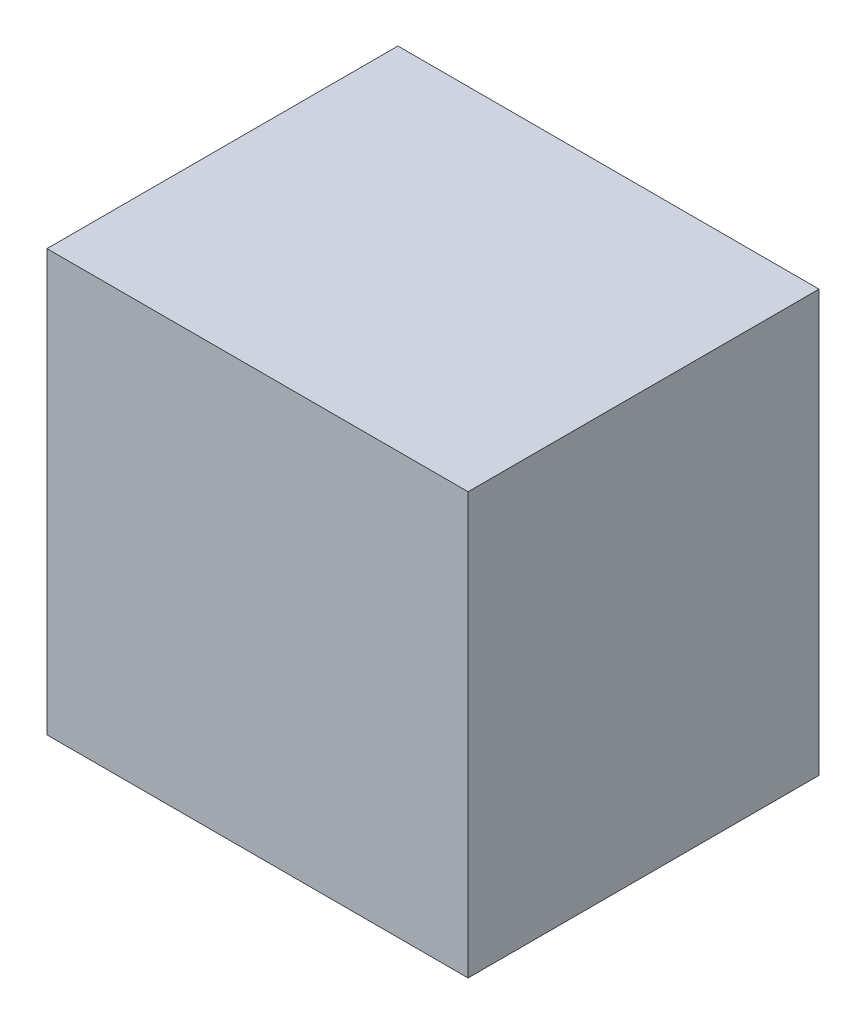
ISO-10303-21;
HEADER;
FILE_DESCRIPTION(('STEP AP214'),'2;1');
FILE_NAME('part.step','',(''),(''),'','','');
FILE_SCHEMA(('AUTOMOTIVE_DESIGN { 1 0 10303 214 1 1 1 1 }'));
ENDSEC;
DATA;
#1=APPLICATION_CONTEXT('core data for automotive mechanical design processes');
#2=APPLICATION_PROTOCOL_DEFINITION('international standard','automotive_design',2000,#1);
#3=PRODUCT_CONTEXT('',#1,'mechanical');
#4=PRODUCT('Part','Part','',(#3));
#5=PRODUCT_RELATED_PRODUCT_CATEGORY('part','',(#4));
#6=PRODUCT_DEFINITION_FORMATION('','',#4);
#7=PRODUCT_DEFINITION_CONTEXT('part definition',#1,'design');
#8=PRODUCT_DEFINITION('design','',#6,#7);
#9=PRODUCT_DEFINITION_SHAPE('','',#8);
#10=(LENGTH_UNIT() NAMED_UNIT(*) SI_UNIT(.MILLI.,.METRE.));
#11=(NAMED_UNIT(*) PLANE_ANGLE_UNIT() SI_UNIT($,.RADIAN.));
#12=(NAMED_UNIT(*) SI_UNIT($,.STERADIAN.) SOLID_ANGLE_UNIT());
#13=UNCERTAINTY_MEASURE_WITH_UNIT(LENGTH_MEASURE(1.E-05),#10,'distance_accuracy_value','');
#14=(GEOMETRIC_REPRESENTATION_CONTEXT(3) GLOBAL_UNCERTAINTY_ASSIGNED_CONTEXT((#13)) GLOBAL_UNIT_ASSIGNED_CONTEXT((#10,
#11,#12)) REPRESENTATION_CONTEXT('',''));
#15=CARTESIAN_POINT('',(0.,0.,0.));
#16=DIRECTION('',(0.,0.,1.));
#17=DIRECTION('',(1.,0.,0.));
#18=AXIS2_PLACEMENT_3D('',#15,#16,#17);
#19=CARTESIAN_POINT('',(0.381,0.381,0.635));
#20=DIRECTION('',(0.,0.,-1.));
#21=DIRECTION('',(-1.,0.,0.));
#22=AXIS2_PLACEMENT_3D('',#19,#20,#21);
#23=PLANE('',#22);
#24=DIRECTION('',(0.,1.,0.));
#25=VECTOR('',#24,1.);
#26=CARTESIAN_POINT('',(-0.381,0.381,0.635));
#27=LINE('',#26,#25);
#28=CARTESIAN_POINT('',(-0.381,0.381,0.635));
#29=VERTEX_POINT('',#28);
#30=CARTESIAN_POINT('',(-0.381,-0.381,0.635));
#31=VERTEX_POINT('',#30);
#32=EDGE_CURVE('E55',#29,#31,#27,.F.);
#33=ORIENTED_EDGE('',*,*,#32,.T.);
#34=DIRECTION('',(1.,0.,0.));
#35=VECTOR('',#34,1.);
#36=CARTESIAN_POINT('',(-0.381,-0.381,0.635));
#37=LINE('',#36,#35);
#38=CARTESIAN_POINT('',(0.381,-0.381,0.635));
#39=VERTEX_POINT('',#38);
#40=EDGE_CURVE('E57',#31,#39,#37,.T.);
#41=ORIENTED_EDGE('',*,*,#40,.T.);
#42=DIRECTION('',(0.,1.,0.));
#43=VECTOR('',#42,1.);
#44=CARTESIAN_POINT('',(0.381,-0.381,0.635));
#45=LINE('',#44,#43);
#46=CARTESIAN_POINT('',(0.381,0.381,0.635));
#47=VERTEX_POINT('',#46);
#48=EDGE_CURVE('E20',#39,#47,#45,.T.);
#49=ORIENTED_EDGE('',*,*,#48,.T.);
#50=DIRECTION('',(1.,0.,0.));
#51=VECTOR('',#50,1.);
#52=CARTESIAN_POINT('',(0.381,0.381,0.635));
#53=LINE('',#52,#51);
#54=EDGE_CURVE('E80',#47,#29,#53,.F.);
#55=ORIENTED_EDGE('',*,*,#54,.T.);
#56=EDGE_LOOP('',(#33,#41,#49,#55));
#57=FACE_BOUND('',#56,.T.);
#58=ADVANCED_FACE('F17',(#57),#23,.F.);
#59=CARTESIAN_POINT('',(0.381,-0.381,0.));
#60=DIRECTION('',(-1.,0.,0.));
#61=DIRECTION('',(0.,0.,1.));
#62=AXIS2_PLACEMENT_3D('',#59,#60,#61);
#63=PLANE('',#62);
#64=DIRECTION('',(0.,0.,-1.));
#65=VECTOR('',#64,1.);
#66=CARTESIAN_POINT('',(0.381,0.381,0.));
#67=LINE('',#66,#65);
#68=CARTESIAN_POINT('',(0.381,0.381,0.));
#69=VERTEX_POINT('',#68);
#70=EDGE_CURVE('E68',#69,#47,#67,.F.);
#71=ORIENTED_EDGE('',*,*,#70,.T.);
#72=ORIENTED_EDGE('',*,*,#48,.F.);
#73=DIRECTION('',(0.,0.,1.));
#74=VECTOR('',#73,1.);
#75=CARTESIAN_POINT('',(0.381,-0.381,0.));
#76=LINE('',#75,#74);
#77=CARTESIAN_POINT('',(0.381,-0.381,0.));
#78=VERTEX_POINT('',#77);
#79=EDGE_CURVE('E63',#39,#78,#76,.F.);
#80=ORIENTED_EDGE('',*,*,#79,.T.);
#81=DIRECTION('',(0.,1.,0.));
#82=VECTOR('',#81,1.);
#83=CARTESIAN_POINT('',(0.381,0.381,0.));
#84=LINE('',#83,#82);
#85=EDGE_CURVE('E83',#69,#78,#84,.F.);
#86=ORIENTED_EDGE('',*,*,#85,.F.);
#87=EDGE_LOOP('',(#71,#72,#80,#86));
#88=FACE_BOUND('',#87,.T.);
#89=ADVANCED_FACE('F65',(#88),#63,.F.);
#90=CARTESIAN_POINT('',(-0.381,-0.381,0.));
#91=DIRECTION('',(0.,1.,0.));
#92=DIRECTION('',(0.,0.,1.));
#93=AXIS2_PLACEMENT_3D('',#90,#91,#92);
#94=PLANE('',#93);
#95=ORIENTED_EDGE('',*,*,#79,.F.);
#96=ORIENTED_EDGE('',*,*,#40,.F.);
#97=DIRECTION('',(0.,0.,-1.));
#98=VECTOR('',#97,1.);
#99=CARTESIAN_POINT('',(-0.381,-0.381,0.));
#100=LINE('',#99,#98);
#101=CARTESIAN_POINT('',(-0.381,-0.381,0.));
#102=VERTEX_POINT('',#101);
#103=EDGE_CURVE('E75',#31,#102,#100,.T.);
#104=ORIENTED_EDGE('',*,*,#103,.T.);
#105=DIRECTION('',(-1.,0.,0.));
#106=VECTOR('',#105,1.);
#107=CARTESIAN_POINT('',(0.381,-0.381,0.));
#108=LINE('',#107,#106);
#109=EDGE_CURVE('E72',#78,#102,#108,.T.);
#110=ORIENTED_EDGE('',*,*,#109,.F.);
#111=EDGE_LOOP('',(#95,#96,#104,#110));
#112=FACE_BOUND('',#111,.T.);
#113=ADVANCED_FACE('F70',(#112),#94,.F.);
#114=CARTESIAN_POINT('',(-0.381,0.381,0.));
#115=DIRECTION('',(1.,0.,0.));
#116=DIRECTION('',(0.,0.,-1.));
#117=AXIS2_PLACEMENT_3D('',#114,#115,#116);
#118=PLANE('',#117);
#119=ORIENTED_EDGE('',*,*,#103,.F.);
#120=ORIENTED_EDGE('',*,*,#32,.F.);
#121=DIRECTION('',(0.,0.,-1.));
#122=VECTOR('',#121,1.);
#123=CARTESIAN_POINT('',(-0.381,0.381,0.));
#124=LINE('',#123,#122);
#125=CARTESIAN_POINT('',(-0.381,0.381,0.));
#126=VERTEX_POINT('',#125);
#127=EDGE_CURVE('E35',#29,#126,#124,.T.);
#128=ORIENTED_EDGE('',*,*,#127,.T.);
#129=DIRECTION('',(0.,1.,0.));
#130=VECTOR('',#129,1.);
#131=CARTESIAN_POINT('',(-0.381,0.381,0.));
#132=LINE('',#131,#130);
#133=EDGE_CURVE('E26',#102,#126,#132,.T.);
#134=ORIENTED_EDGE('',*,*,#133,.F.);
#135=EDGE_LOOP('',(#119,#120,#128,#134));
#136=FACE_BOUND('',#135,.T.);
#137=ADVANCED_FACE('F89',(#136),#118,.F.);
#138=CARTESIAN_POINT('',(0.381,0.381,0.));
#139=DIRECTION('',(0.,-1.,0.));
#140=DIRECTION('',(0.,0.,-1.));
#141=AXIS2_PLACEMENT_3D('',#138,#139,#140);
#142=PLANE('',#141);
#143=ORIENTED_EDGE('',*,*,#127,.F.);
#144=ORIENTED_EDGE('',*,*,#54,.F.);
#145=ORIENTED_EDGE('',*,*,#70,.F.);
#146=DIRECTION('',(-1.,0.,0.));
#147=VECTOR('',#146,1.);
#148=CARTESIAN_POINT('',(0.381,0.381,0.));
#149=LINE('',#148,#147);
#150=EDGE_CURVE('E11',#126,#69,#149,.F.);
#151=ORIENTED_EDGE('',*,*,#150,.F.);
#152=EDGE_LOOP('',(#143,#144,#145,#151));
#153=FACE_BOUND('',#152,.T.);
#154=ADVANCED_FACE('F91',(#153),#142,.F.);
#155=CARTESIAN_POINT('',(0.381,0.381,0.));
#156=DIRECTION('',(0.,0.,-1.));
#157=DIRECTION('',(-1.,0.,0.));
#158=AXIS2_PLACEMENT_3D('',#155,#156,#157);
#159=PLANE('',#158);
#160=ORIENTED_EDGE('',*,*,#133,.T.);
#161=ORIENTED_EDGE('',*,*,#150,.T.);
#162=ORIENTED_EDGE('',*,*,#85,.T.);
#163=ORIENTED_EDGE('',*,*,#109,.T.);
#164=EDGE_LOOP('',(#160,#161,#162,#163));
#165=FACE_BOUND('',#164,.T.);
#166=ADVANCED_FACE('F88',(#165),#159,.T.);
#167=CLOSED_SHELL('',(#58,#89,#113,#137,#154,#166));
#168=MANIFOLD_SOLID_BREP('B1',#167);
#169=ADVANCED_BREP_SHAPE_REPRESENTATION('',(#18,#168),#14);
#170=SHAPE_DEFINITION_REPRESENTATION(#9,#169);
ENDSEC;
END-ISO-10303-21;
